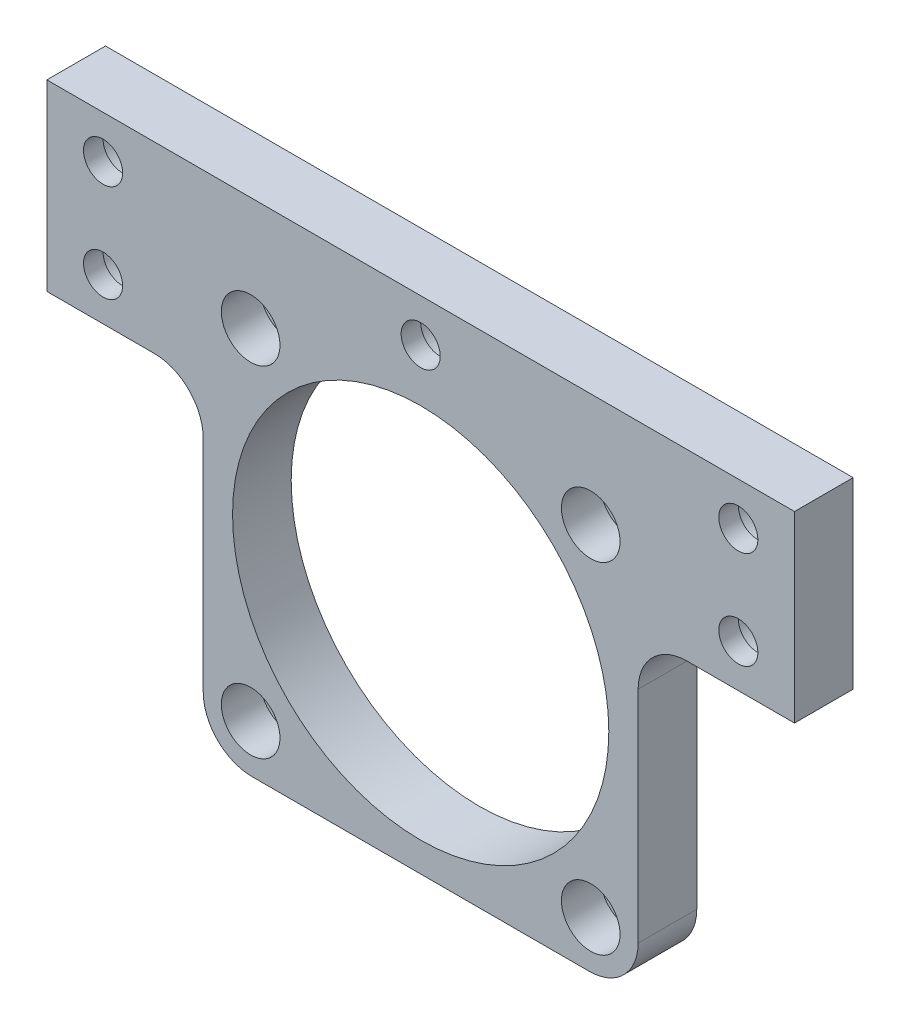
ISO-10303-21;
HEADER;
FILE_DESCRIPTION(('STEP AP214'),'2;1');
FILE_NAME('part.step','',(''),(''),'','','');
FILE_SCHEMA(('AUTOMOTIVE_DESIGN { 1 0 10303 214 1 1 1 1 }'));
ENDSEC;
DATA;
#1=APPLICATION_CONTEXT('core data for automotive mechanical design processes');
#2=APPLICATION_PROTOCOL_DEFINITION('international standard','automotive_design',2000,#1);
#3=PRODUCT_CONTEXT('',#1,'mechanical');
#4=PRODUCT('Part','Part','',(#3));
#5=PRODUCT_RELATED_PRODUCT_CATEGORY('part','',(#4));
#6=PRODUCT_DEFINITION_FORMATION('','',#4);
#7=PRODUCT_DEFINITION_CONTEXT('part definition',#1,'design');
#8=PRODUCT_DEFINITION('design','',#6,#7);
#9=PRODUCT_DEFINITION_SHAPE('','',#8);
#10=(LENGTH_UNIT() NAMED_UNIT(*) SI_UNIT(.MILLI.,.METRE.));
#11=(NAMED_UNIT(*) PLANE_ANGLE_UNIT() SI_UNIT($,.RADIAN.));
#12=(NAMED_UNIT(*) SI_UNIT($,.STERADIAN.) SOLID_ANGLE_UNIT());
#13=UNCERTAINTY_MEASURE_WITH_UNIT(LENGTH_MEASURE(1.E-05),#10,'distance_accuracy_value','');
#14=(GEOMETRIC_REPRESENTATION_CONTEXT(3) GLOBAL_UNCERTAINTY_ASSIGNED_CONTEXT((#13)) GLOBAL_UNIT_ASSIGNED_CONTEXT((#10,
#11,#12)) REPRESENTATION_CONTEXT('',''));
#15=CARTESIAN_POINT('',(0.,0.,0.));
#16=DIRECTION('',(0.,0.,1.));
#17=DIRECTION('',(1.,0.,0.));
#18=AXIS2_PLACEMENT_3D('',#15,#16,#17);
#19=CARTESIAN_POINT('',(11.5,-28.75,23.3137084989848));
#20=DIRECTION('',(0.,0.,-1.));
#21=DIRECTION('',(-1.,0.,0.));
#22=AXIS2_PLACEMENT_3D('',#19,#20,#21);
#23=CYLINDRICAL_SURFACE('',#22,3.99999999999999);
#24=CARTESIAN_POINT('',(11.5,-28.75,12.));
#25=DIRECTION('',(0.,0.,1.));
#26=DIRECTION('',(1.,0.,0.));
#27=AXIS2_PLACEMENT_3D('',#24,#25,#26);
#28=CIRCLE('',#27,3.99999999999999);
#29=CARTESIAN_POINT('',(15.5,-28.75,12.));
#30=VERTEX_POINT('',#29);
#31=EDGE_CURVE('E224',#30,#30,#28,.F.);
#32=ORIENTED_EDGE('',*,*,#31,.F.);
#33=EDGE_LOOP('',(#32));
#34=FACE_BOUND('',#33,.T.);
#35=CARTESIAN_POINT('',(11.5,-28.75,8.));
#36=DIRECTION('',(0.,0.,-1.));
#37=DIRECTION('',(-1.,0.,0.));
#38=AXIS2_PLACEMENT_3D('',#35,#36,#37);
#39=CIRCLE('',#38,3.99999999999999);
#40=CARTESIAN_POINT('',(7.50000000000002,-28.75,8.));
#41=VERTEX_POINT('',#40);
#42=EDGE_CURVE('E34',#41,#41,#39,.F.);
#43=ORIENTED_EDGE('',*,*,#42,.F.);
#44=EDGE_LOOP('',(#43));
#45=FACE_BOUND('',#44,.T.);
#46=ADVANCED_FACE('F30',(#34,#45),#23,.F.);
#47=CARTESIAN_POINT('',(11.5,-8.75000000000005,23.3137084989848));
#48=DIRECTION('',(0.,0.,-1.));
#49=DIRECTION('',(-1.,0.,0.));
#50=AXIS2_PLACEMENT_3D('',#47,#48,#49);
#51=CYLINDRICAL_SURFACE('',#50,3.99999999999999);
#52=CARTESIAN_POINT('',(11.5,-8.75000000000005,12.));
#53=DIRECTION('',(0.,0.,1.));
#54=DIRECTION('',(1.,0.,0.));
#55=AXIS2_PLACEMENT_3D('',#52,#53,#54);
#56=CIRCLE('',#55,3.99999999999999);
#57=CARTESIAN_POINT('',(15.5,-8.75000000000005,12.));
#58=VERTEX_POINT('',#57);
#59=EDGE_CURVE('E266',#58,#58,#56,.F.);
#60=ORIENTED_EDGE('',*,*,#59,.F.);
#61=EDGE_LOOP('',(#60));
#62=FACE_BOUND('',#61,.T.);
#63=CARTESIAN_POINT('',(11.5,-8.75000000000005,8.));
#64=DIRECTION('',(0.,0.,-1.));
#65=DIRECTION('',(-1.,0.,0.));
#66=AXIS2_PLACEMENT_3D('',#63,#64,#65);
#67=CIRCLE('',#66,3.99999999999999);
#68=CARTESIAN_POINT('',(7.50000000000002,-8.75000000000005,8.));
#69=VERTEX_POINT('',#68);
#70=EDGE_CURVE('E235',#69,#69,#67,.F.);
#71=ORIENTED_EDGE('',*,*,#70,.F.);
#72=EDGE_LOOP('',(#71));
#73=FACE_BOUND('',#72,.T.);
#74=ADVANCED_FACE('F356',(#62,#73),#51,.F.);
#75=CARTESIAN_POINT('',(76.5,-8.75000000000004,23.3137084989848));
#76=DIRECTION('',(0.,0.,-1.));
#77=DIRECTION('',(-1.,0.,0.));
#78=AXIS2_PLACEMENT_3D('',#75,#76,#77);
#79=CYLINDRICAL_SURFACE('',#78,3.99999999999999);
#80=CARTESIAN_POINT('',(76.5,-8.75000000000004,12.));
#81=DIRECTION('',(0.,0.,1.));
#82=DIRECTION('',(1.,0.,0.));
#83=AXIS2_PLACEMENT_3D('',#80,#81,#82);
#84=CIRCLE('',#83,3.99999999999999);
#85=CARTESIAN_POINT('',(80.5,-8.75000000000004,12.));
#86=VERTEX_POINT('',#85);
#87=EDGE_CURVE('E269',#86,#86,#84,.F.);
#88=ORIENTED_EDGE('',*,*,#87,.F.);
#89=EDGE_LOOP('',(#88));
#90=FACE_BOUND('',#89,.T.);
#91=CARTESIAN_POINT('',(76.5,-8.75000000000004,8.));
#92=DIRECTION('',(0.,0.,-1.));
#93=DIRECTION('',(-1.,0.,0.));
#94=AXIS2_PLACEMENT_3D('',#91,#92,#93);
#95=CIRCLE('',#94,3.99999999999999);
#96=CARTESIAN_POINT('',(72.5,-8.75000000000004,8.));
#97=VERTEX_POINT('',#96);
#98=EDGE_CURVE('E231',#97,#97,#95,.F.);
#99=ORIENTED_EDGE('',*,*,#98,.F.);
#100=EDGE_LOOP('',(#99));
#101=FACE_BOUND('',#100,.T.);
#102=ADVANCED_FACE('F362',(#90,#101),#79,.F.);
#103=CARTESIAN_POINT('',(141.5,-28.75,23.3137084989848));
#104=DIRECTION('',(0.,0.,-1.));
#105=DIRECTION('',(-1.,0.,0.));
#106=AXIS2_PLACEMENT_3D('',#103,#104,#105);
#107=CYLINDRICAL_SURFACE('',#106,3.99999999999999);
#108=CARTESIAN_POINT('',(141.5,-28.75,12.));
#109=DIRECTION('',(0.,0.,1.));
#110=DIRECTION('',(1.,0.,0.));
#111=AXIS2_PLACEMENT_3D('',#108,#109,#110);
#112=CIRCLE('',#111,3.99999999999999);
#113=CARTESIAN_POINT('',(145.5,-28.75,12.));
#114=VERTEX_POINT('',#113);
#115=EDGE_CURVE('E272',#114,#114,#112,.F.);
#116=ORIENTED_EDGE('',*,*,#115,.F.);
#117=EDGE_LOOP('',(#116));
#118=FACE_BOUND('',#117,.T.);
#119=CARTESIAN_POINT('',(141.5,-28.75,8.));
#120=DIRECTION('',(0.,0.,-1.));
#121=DIRECTION('',(-1.,0.,0.));
#122=AXIS2_PLACEMENT_3D('',#119,#120,#121);
#123=CIRCLE('',#122,3.99999999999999);
#124=CARTESIAN_POINT('',(137.5,-28.75,8.));
#125=VERTEX_POINT('',#124);
#126=EDGE_CURVE('E226',#125,#125,#123,.F.);
#127=ORIENTED_EDGE('',*,*,#126,.F.);
#128=EDGE_LOOP('',(#127));
#129=FACE_BOUND('',#128,.T.);
#130=ADVANCED_FACE('F373',(#118,#129),#107,.F.);
#131=CARTESIAN_POINT('',(141.5,-8.75000000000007,23.3137084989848));
#132=DIRECTION('',(0.,0.,-1.));
#133=DIRECTION('',(-1.,0.,0.));
#134=AXIS2_PLACEMENT_3D('',#131,#132,#133);
#135=CYLINDRICAL_SURFACE('',#134,3.99999999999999);
#136=CARTESIAN_POINT('',(141.5,-8.75000000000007,12.));
#137=DIRECTION('',(0.,0.,1.));
#138=DIRECTION('',(1.,0.,0.));
#139=AXIS2_PLACEMENT_3D('',#136,#137,#138);
#140=CIRCLE('',#139,3.99999999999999);
#141=CARTESIAN_POINT('',(145.5,-8.75000000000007,12.));
#142=VERTEX_POINT('',#141);
#143=EDGE_CURVE('E275',#142,#142,#140,.F.);
#144=ORIENTED_EDGE('',*,*,#143,.F.);
#145=EDGE_LOOP('',(#144));
#146=FACE_BOUND('',#145,.T.);
#147=CARTESIAN_POINT('',(141.5,-8.75000000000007,8.));
#148=DIRECTION('',(0.,0.,-1.));
#149=DIRECTION('',(-1.,0.,0.));
#150=AXIS2_PLACEMENT_3D('',#147,#148,#149);
#151=CIRCLE('',#150,3.99999999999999);
#152=CARTESIAN_POINT('',(137.5,-8.75000000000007,8.));
#153=VERTEX_POINT('',#152);
#154=EDGE_CURVE('E221',#153,#153,#151,.F.);
#155=ORIENTED_EDGE('',*,*,#154,.F.);
#156=EDGE_LOOP('',(#155));
#157=FACE_BOUND('',#156,.T.);
#158=ADVANCED_FACE('F377',(#146,#157),#135,.F.);
#159=CARTESIAN_POINT('',(111.3,-92.7999999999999,12.));
#160=DIRECTION('',(0.,0.,-1.));
#161=DIRECTION('',(-1.,0.,0.));
#162=AXIS2_PLACEMENT_3D('',#159,#160,#161);
#163=CYLINDRICAL_SURFACE('',#162,4.24999999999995);
#164=CARTESIAN_POINT('',(111.3,-92.7999999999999,0.));
#165=DIRECTION('',(0.,0.,1.));
#166=DIRECTION('',(1.,0.,0.));
#167=AXIS2_PLACEMENT_3D('',#164,#165,#166);
#168=CIRCLE('',#167,4.24999999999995);
#169=CARTESIAN_POINT('',(115.55,-92.7999999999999,0.));
#170=VERTEX_POINT('',#169);
#171=EDGE_CURVE('E303',#170,#170,#168,.T.);
#172=ORIENTED_EDGE('',*,*,#171,.F.);
#173=EDGE_LOOP('',(#172));
#174=FACE_BOUND('',#173,.T.);
#175=CARTESIAN_POINT('',(111.3,-92.7999999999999,4.));
#176=DIRECTION('',(0.,0.,1.));
#177=DIRECTION('',(1.,0.,0.));
#178=AXIS2_PLACEMENT_3D('',#175,#176,#177);
#179=CIRCLE('',#178,4.24999999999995);
#180=CARTESIAN_POINT('',(115.55,-92.7999999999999,4.));
#181=VERTEX_POINT('',#180);
#182=EDGE_CURVE('E216',#181,#181,#179,.T.);
#183=ORIENTED_EDGE('',*,*,#182,.T.);
#184=EDGE_LOOP('',(#183));
#185=FACE_BOUND('',#184,.T.);
#186=ADVANCED_FACE('F381',(#174,#185),#163,.F.);
#187=CARTESIAN_POINT('',(41.7,-92.7999999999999,12.));
#188=DIRECTION('',(0.,0.,-1.));
#189=DIRECTION('',(-1.,0.,0.));
#190=AXIS2_PLACEMENT_3D('',#187,#188,#189);
#191=CYLINDRICAL_SURFACE('',#190,4.24999999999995);
#192=CARTESIAN_POINT('',(41.7,-92.7999999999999,0.));
#193=DIRECTION('',(0.,0.,1.));
#194=DIRECTION('',(1.,0.,0.));
#195=AXIS2_PLACEMENT_3D('',#192,#193,#194);
#196=CIRCLE('',#195,4.24999999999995);
#197=CARTESIAN_POINT('',(45.95,-92.7999999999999,0.));
#198=VERTEX_POINT('',#197);
#199=EDGE_CURVE('E297',#198,#198,#196,.T.);
#200=ORIENTED_EDGE('',*,*,#199,.F.);
#201=EDGE_LOOP('',(#200));
#202=FACE_BOUND('',#201,.T.);
#203=CARTESIAN_POINT('',(41.7,-92.7999999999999,4.));
#204=DIRECTION('',(0.,0.,1.));
#205=DIRECTION('',(1.,0.,0.));
#206=AXIS2_PLACEMENT_3D('',#203,#204,#205);
#207=CIRCLE('',#206,4.24999999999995);
#208=CARTESIAN_POINT('',(45.95,-92.7999999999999,4.));
#209=VERTEX_POINT('',#208);
#210=EDGE_CURVE('E211',#209,#209,#207,.T.);
#211=ORIENTED_EDGE('',*,*,#210,.T.);
#212=EDGE_LOOP('',(#211));
#213=FACE_BOUND('',#212,.T.);
#214=ADVANCED_FACE('F420',(#202,#213),#191,.F.);
#215=CARTESIAN_POINT('',(111.3,-23.1999999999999,12.));
#216=DIRECTION('',(0.,0.,-1.));
#217=DIRECTION('',(-1.,0.,0.));
#218=AXIS2_PLACEMENT_3D('',#215,#216,#217);
#219=CYLINDRICAL_SURFACE('',#218,4.24999999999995);
#220=CARTESIAN_POINT('',(111.3,-23.1999999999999,0.));
#221=DIRECTION('',(0.,0.,1.));
#222=DIRECTION('',(1.,0.,0.));
#223=AXIS2_PLACEMENT_3D('',#220,#221,#222);
#224=CIRCLE('',#223,4.24999999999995);
#225=CARTESIAN_POINT('',(115.55,-23.1999999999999,0.));
#226=VERTEX_POINT('',#225);
#227=EDGE_CURVE('E300',#226,#226,#224,.T.);
#228=ORIENTED_EDGE('',*,*,#227,.F.);
#229=EDGE_LOOP('',(#228));
#230=FACE_BOUND('',#229,.T.);
#231=CARTESIAN_POINT('',(111.3,-23.1999999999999,4.));
#232=DIRECTION('',(0.,0.,1.));
#233=DIRECTION('',(1.,0.,0.));
#234=AXIS2_PLACEMENT_3D('',#231,#232,#233);
#235=CIRCLE('',#234,4.24999999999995);
#236=CARTESIAN_POINT('',(115.55,-23.1999999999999,4.));
#237=VERTEX_POINT('',#236);
#238=EDGE_CURVE('E206',#237,#237,#235,.T.);
#239=ORIENTED_EDGE('',*,*,#238,.T.);
#240=EDGE_LOOP('',(#239));
#241=FACE_BOUND('',#240,.T.);
#242=ADVANCED_FACE('F418',(#230,#241),#219,.F.);
#243=CARTESIAN_POINT('',(41.7,-23.1999999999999,12.));
#244=DIRECTION('',(0.,0.,-1.));
#245=DIRECTION('',(-1.,0.,0.));
#246=AXIS2_PLACEMENT_3D('',#243,#244,#245);
#247=CYLINDRICAL_SURFACE('',#246,4.24999999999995);
#248=CARTESIAN_POINT('',(41.7,-23.1999999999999,0.));
#249=DIRECTION('',(0.,0.,1.));
#250=DIRECTION('',(1.,0.,0.));
#251=AXIS2_PLACEMENT_3D('',#248,#249,#250);
#252=CIRCLE('',#251,4.24999999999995);
#253=CARTESIAN_POINT('',(45.95,-23.1999999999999,0.));
#254=VERTEX_POINT('',#253);
#255=EDGE_CURVE('E204',#254,#254,#252,.T.);
#256=ORIENTED_EDGE('',*,*,#255,.F.);
#257=EDGE_LOOP('',(#256));
#258=FACE_BOUND('',#257,.T.);
#259=CARTESIAN_POINT('',(41.7,-23.1999999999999,4.));
#260=DIRECTION('',(0.,0.,1.));
#261=DIRECTION('',(1.,0.,0.));
#262=AXIS2_PLACEMENT_3D('',#259,#260,#261);
#263=CIRCLE('',#262,4.24999999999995);
#264=CARTESIAN_POINT('',(45.95,-23.1999999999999,4.));
#265=VERTEX_POINT('',#264);
#266=EDGE_CURVE('E201',#265,#265,#263,.T.);
#267=ORIENTED_EDGE('',*,*,#266,.T.);
#268=EDGE_LOOP('',(#267));
#269=FACE_BOUND('',#268,.T.);
#270=ADVANCED_FACE('F415',(#258,#269),#247,.F.);
#271=CARTESIAN_POINT('',(42.0000000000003,-92.4999999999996,12.));
#272=DIRECTION('',(0.,0.,1.));
#273=DIRECTION('',(1.,0.,0.));
#274=AXIS2_PLACEMENT_3D('',#271,#272,#273);
#275=PLANE('',#274);
#276=ORIENTED_EDGE('',*,*,#31,.T.);
#277=EDGE_LOOP('',(#276));
#278=FACE_BOUND('',#277,.T.);
#279=ORIENTED_EDGE('',*,*,#59,.T.);
#280=EDGE_LOOP('',(#279));
#281=FACE_BOUND('',#280,.T.);
#282=ORIENTED_EDGE('',*,*,#87,.T.);
#283=EDGE_LOOP('',(#282));
#284=FACE_BOUND('',#283,.T.);
#285=ORIENTED_EDGE('',*,*,#115,.T.);
#286=EDGE_LOOP('',(#285));
#287=FACE_BOUND('',#286,.T.);
#288=ORIENTED_EDGE('',*,*,#143,.T.);
#289=EDGE_LOOP('',(#288));
#290=FACE_BOUND('',#289,.T.);
#291=CARTESIAN_POINT('',(111.3,-92.7999999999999,12.));
#292=DIRECTION('',(0.,0.,1.));
#293=DIRECTION('',(1.,0.,0.));
#294=AXIS2_PLACEMENT_3D('',#291,#292,#293);
#295=CIRCLE('',#294,5.99999999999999);
#296=CARTESIAN_POINT('',(117.3,-92.7999999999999,12.));
#297=VERTEX_POINT('',#296);
#298=EDGE_CURVE('E278',#297,#297,#295,.T.);
#299=ORIENTED_EDGE('',*,*,#298,.F.);
#300=EDGE_LOOP('',(#299));
#301=FACE_BOUND('',#300,.T.);
#302=CARTESIAN_POINT('',(41.7,-92.7999999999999,12.));
#303=DIRECTION('',(0.,0.,1.));
#304=DIRECTION('',(1.,0.,0.));
#305=AXIS2_PLACEMENT_3D('',#302,#303,#304);
#306=CIRCLE('',#305,5.99999999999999);
#307=CARTESIAN_POINT('',(47.7,-92.7999999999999,12.));
#308=VERTEX_POINT('',#307);
#309=EDGE_CURVE('E219',#308,#308,#306,.T.);
#310=ORIENTED_EDGE('',*,*,#309,.F.);
#311=EDGE_LOOP('',(#310));
#312=FACE_BOUND('',#311,.T.);
#313=CARTESIAN_POINT('',(111.3,-23.1999999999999,12.));
#314=DIRECTION('',(0.,0.,1.));
#315=DIRECTION('',(1.,0.,0.));
#316=AXIS2_PLACEMENT_3D('',#313,#314,#315);
#317=CIRCLE('',#316,5.99999999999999);
#318=CARTESIAN_POINT('',(117.3,-23.1999999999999,12.));
#319=VERTEX_POINT('',#318);
#320=EDGE_CURVE('E214',#319,#319,#317,.T.);
#321=ORIENTED_EDGE('',*,*,#320,.F.);
#322=EDGE_LOOP('',(#321));
#323=FACE_BOUND('',#322,.T.);
#324=CARTESIAN_POINT('',(41.7,-23.1999999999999,12.));
#325=DIRECTION('',(0.,0.,1.));
#326=DIRECTION('',(1.,0.,0.));
#327=AXIS2_PLACEMENT_3D('',#324,#325,#326);
#328=CIRCLE('',#327,5.99999999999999);
#329=CARTESIAN_POINT('',(47.7,-23.1999999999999,12.));
#330=VERTEX_POINT('',#329);
#331=EDGE_CURVE('E209',#330,#330,#328,.T.);
#332=ORIENTED_EDGE('',*,*,#331,.F.);
#333=EDGE_LOOP('',(#332));
#334=FACE_BOUND('',#333,.T.);
#335=CARTESIAN_POINT('',(42.0000000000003,-92.4999999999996,12.));
#336=DIRECTION('',(0.,0.,1.));
#337=DIRECTION('',(1.,0.,0.));
#338=AXIS2_PLACEMENT_3D('',#335,#336,#337);
#339=CIRCLE('',#338,10.0000000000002);
#340=CARTESIAN_POINT('',(32.0000000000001,-92.4999999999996,12.));
#341=VERTEX_POINT('',#340);
#342=CARTESIAN_POINT('',(42.0000000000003,-102.5,12.));
#343=VERTEX_POINT('',#342);
#344=EDGE_CURVE('E177',#341,#343,#339,.T.);
#345=ORIENTED_EDGE('',*,*,#344,.T.);
#346=DIRECTION('',(1.,0.,0.));
#347=VECTOR('',#346,1.);
#348=CARTESIAN_POINT('',(42.0000000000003,-102.5,12.));
#349=LINE('',#348,#347);
#350=CARTESIAN_POINT('',(111.,-102.5,12.));
#351=VERTEX_POINT('',#350);
#352=EDGE_CURVE('E104',#343,#351,#349,.T.);
#353=ORIENTED_EDGE('',*,*,#352,.T.);
#354=CARTESIAN_POINT('',(111.,-92.4999999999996,12.));
#355=DIRECTION('',(0.,0.,1.));
#356=DIRECTION('',(1.,0.,0.));
#357=AXIS2_PLACEMENT_3D('',#354,#355,#356);
#358=CIRCLE('',#357,10.0000000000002);
#359=CARTESIAN_POINT('',(121.,-92.4999999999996,12.));
#360=VERTEX_POINT('',#359);
#361=EDGE_CURVE('E313',#351,#360,#358,.T.);
#362=ORIENTED_EDGE('',*,*,#361,.T.);
#363=DIRECTION('',(0.,1.,0.));
#364=VECTOR('',#363,1.);
#365=CARTESIAN_POINT('',(121.,-92.4999999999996,12.));
#366=LINE('',#365,#364);
#367=CARTESIAN_POINT('',(121.,-47.5000000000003,12.));
#368=VERTEX_POINT('',#367);
#369=EDGE_CURVE('E315',#360,#368,#366,.T.);
#370=ORIENTED_EDGE('',*,*,#369,.T.);
#371=CARTESIAN_POINT('',(131.,-47.5000000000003,12.));
#372=DIRECTION('',(0.,0.,-1.));
#373=DIRECTION('',(1.,0.,0.));
#374=AXIS2_PLACEMENT_3D('',#371,#372,#373);
#375=CIRCLE('',#374,10.0000000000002);
#376=CARTESIAN_POINT('',(131.,-37.5000000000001,12.));
#377=VERTEX_POINT('',#376);
#378=EDGE_CURVE('E317',#368,#377,#375,.T.);
#379=ORIENTED_EDGE('',*,*,#378,.T.);
#380=DIRECTION('',(1.,0.,0.));
#381=VECTOR('',#380,1.);
#382=CARTESIAN_POINT('',(153.,-37.5000000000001,12.));
#383=LINE('',#382,#381);
#384=CARTESIAN_POINT('',(153.,-37.5000000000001,12.));
#385=VERTEX_POINT('',#384);
#386=EDGE_CURVE('E319',#377,#385,#383,.T.);
#387=ORIENTED_EDGE('',*,*,#386,.T.);
#388=DIRECTION('',(0.,1.,0.));
#389=VECTOR('',#388,1.);
#390=CARTESIAN_POINT('',(153.,0.,12.));
#391=LINE('',#390,#389);
#392=CARTESIAN_POINT('',(153.,0.,12.));
#393=VERTEX_POINT('',#392);
#394=EDGE_CURVE('E321',#385,#393,#391,.T.);
#395=ORIENTED_EDGE('',*,*,#394,.T.);
#396=DIRECTION('',(-1.,0.,0.));
#397=VECTOR('',#396,1.);
#398=CARTESIAN_POINT('',(0.,0.,12.));
#399=LINE('',#398,#397);
#400=CARTESIAN_POINT('',(0.,0.,12.));
#401=VERTEX_POINT('',#400);
#402=EDGE_CURVE('E323',#393,#401,#399,.T.);
#403=ORIENTED_EDGE('',*,*,#402,.T.);
#404=DIRECTION('',(0.,-1.,0.));
#405=VECTOR('',#404,1.);
#406=CARTESIAN_POINT('',(0.,-37.5000000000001,12.));
#407=LINE('',#406,#405);
#408=CARTESIAN_POINT('',(0.,-37.5000000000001,12.));
#409=VERTEX_POINT('',#408);
#410=EDGE_CURVE('E136',#401,#409,#407,.T.);
#411=ORIENTED_EDGE('',*,*,#410,.T.);
#412=DIRECTION('',(1.,0.,0.));
#413=VECTOR('',#412,1.);
#414=CARTESIAN_POINT('',(21.9999999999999,-37.5000000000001,12.));
#415=LINE('',#414,#413);
#416=CARTESIAN_POINT('',(21.9999999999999,-37.5000000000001,12.));
#417=VERTEX_POINT('',#416);
#418=EDGE_CURVE('E129',#409,#417,#415,.T.);
#419=ORIENTED_EDGE('',*,*,#418,.T.);
#420=CARTESIAN_POINT('',(21.9999999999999,-47.5000000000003,12.));
#421=DIRECTION('',(0.,0.,-1.));
#422=DIRECTION('',(1.,0.,0.));
#423=AXIS2_PLACEMENT_3D('',#420,#421,#422);
#424=CIRCLE('',#423,10.0000000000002);
#425=CARTESIAN_POINT('',(32.0000000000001,-47.5000000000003,12.));
#426=VERTEX_POINT('',#425);
#427=EDGE_CURVE('E134',#417,#426,#424,.T.);
#428=ORIENTED_EDGE('',*,*,#427,.T.);
#429=DIRECTION('',(0.,-1.,0.));
#430=VECTOR('',#429,1.);
#431=CARTESIAN_POINT('',(32.0000000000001,-47.5000000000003,12.));
#432=LINE('',#431,#430);
#433=EDGE_CURVE('E49',#426,#341,#432,.T.);
#434=ORIENTED_EDGE('',*,*,#433,.T.);
#435=EDGE_LOOP('',(#345,#353,#362,#370,#379,#387,#395,#403,#411,#419,#428,#434));
#436=FACE_BOUND('',#435,.T.);
#437=CARTESIAN_POINT('',(76.5000000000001,-58.,12.));
#438=DIRECTION('',(0.,0.,1.));
#439=DIRECTION('',(1.,0.,0.));
#440=AXIS2_PLACEMENT_3D('',#437,#438,#439);
#441=CIRCLE('',#440,38.5);
#442=CARTESIAN_POINT('',(115.,-58.,12.));
#443=VERTEX_POINT('',#442);
#444=EDGE_CURVE('E158',#443,#443,#441,.T.);
#445=ORIENTED_EDGE('',*,*,#444,.F.);
#446=EDGE_LOOP('',(#445));
#447=FACE_BOUND('',#446,.T.);
#448=ADVANCED_FACE('F131',(#278,#281,#284,#287,#290,#301,#312,#323,#334,#436,#447),#275,.T.);
#449=CARTESIAN_POINT('',(42.0000000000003,-92.4999999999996,0.));
#450=DIRECTION('',(0.,0.,1.));
#451=DIRECTION('',(1.,0.,0.));
#452=AXIS2_PLACEMENT_3D('',#449,#450,#451);
#453=PLANE('',#452);
#454=CARTESIAN_POINT('',(11.5,-28.75,0.));
#455=DIRECTION('',(0.,0.,-1.));
#456=DIRECTION('',(-1.,0.,0.));
#457=AXIS2_PLACEMENT_3D('',#454,#455,#456);
#458=CIRCLE('',#457,5.99999999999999);
#459=CARTESIAN_POINT('',(5.50000000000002,-28.75,0.));
#460=VERTEX_POINT('',#459);
#461=EDGE_CURVE('E251',#460,#460,#458,.T.);
#462=ORIENTED_EDGE('',*,*,#461,.F.);
#463=EDGE_LOOP('',(#462));
#464=FACE_BOUND('',#463,.T.);
#465=CARTESIAN_POINT('',(11.5,-8.75000000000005,0.));
#466=DIRECTION('',(0.,0.,-1.));
#467=DIRECTION('',(-1.,0.,0.));
#468=AXIS2_PLACEMENT_3D('',#465,#466,#467);
#469=CIRCLE('',#468,5.99999999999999);
#470=CARTESIAN_POINT('',(5.50000000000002,-8.75000000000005,0.));
#471=VERTEX_POINT('',#470);
#472=EDGE_CURVE('E244',#471,#471,#469,.T.);
#473=ORIENTED_EDGE('',*,*,#472,.F.);
#474=EDGE_LOOP('',(#473));
#475=FACE_BOUND('',#474,.T.);
#476=CARTESIAN_POINT('',(76.5,-8.75000000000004,0.));
#477=DIRECTION('',(0.,0.,-1.));
#478=DIRECTION('',(-1.,0.,0.));
#479=AXIS2_PLACEMENT_3D('',#476,#477,#478);
#480=CIRCLE('',#479,5.99999999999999);
#481=CARTESIAN_POINT('',(70.5,-8.75000000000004,0.));
#482=VERTEX_POINT('',#481);
#483=EDGE_CURVE('E237',#482,#482,#480,.T.);
#484=ORIENTED_EDGE('',*,*,#483,.F.);
#485=EDGE_LOOP('',(#484));
#486=FACE_BOUND('',#485,.T.);
#487=CARTESIAN_POINT('',(141.5,-28.75,0.));
#488=DIRECTION('',(0.,0.,-1.));
#489=DIRECTION('',(-1.,0.,0.));
#490=AXIS2_PLACEMENT_3D('',#487,#488,#489);
#491=CIRCLE('',#490,5.99999999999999);
#492=CARTESIAN_POINT('',(135.5,-28.75,0.));
#493=VERTEX_POINT('',#492);
#494=EDGE_CURVE('E233',#493,#493,#491,.T.);
#495=ORIENTED_EDGE('',*,*,#494,.F.);
#496=EDGE_LOOP('',(#495));
#497=FACE_BOUND('',#496,.T.);
#498=CARTESIAN_POINT('',(141.5,-8.75000000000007,0.));
#499=DIRECTION('',(0.,0.,-1.));
#500=DIRECTION('',(-1.,0.,0.));
#501=AXIS2_PLACEMENT_3D('',#498,#499,#500);
#502=CIRCLE('',#501,5.99999999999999);
#503=CARTESIAN_POINT('',(135.5,-8.75000000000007,0.));
#504=VERTEX_POINT('',#503);
#505=EDGE_CURVE('E229',#504,#504,#502,.T.);
#506=ORIENTED_EDGE('',*,*,#505,.F.);
#507=EDGE_LOOP('',(#506));
#508=FACE_BOUND('',#507,.T.);
#509=ORIENTED_EDGE('',*,*,#199,.T.);
#510=EDGE_LOOP('',(#509));
#511=FACE_BOUND('',#510,.T.);
#512=ORIENTED_EDGE('',*,*,#171,.T.);
#513=EDGE_LOOP('',(#512));
#514=FACE_BOUND('',#513,.T.);
#515=CARTESIAN_POINT('',(42.0000000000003,-92.4999999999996,0.));
#516=DIRECTION('',(0.,0.,1.));
#517=DIRECTION('',(1.,0.,0.));
#518=AXIS2_PLACEMENT_3D('',#515,#516,#517);
#519=CIRCLE('',#518,10.0000000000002);
#520=CARTESIAN_POINT('',(32.0000000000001,-92.4999999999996,0.));
#521=VERTEX_POINT('',#520);
#522=CARTESIAN_POINT('',(42.0000000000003,-102.5,0.));
#523=VERTEX_POINT('',#522);
#524=EDGE_CURVE('E154',#521,#523,#519,.T.);
#525=ORIENTED_EDGE('',*,*,#524,.F.);
#526=DIRECTION('',(0.,-1.,0.));
#527=VECTOR('',#526,1.);
#528=CARTESIAN_POINT('',(32.0000000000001,-47.5000000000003,0.));
#529=LINE('',#528,#527);
#530=CARTESIAN_POINT('',(32.0000000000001,-47.5000000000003,0.));
#531=VERTEX_POINT('',#530);
#532=EDGE_CURVE('E96',#531,#521,#529,.T.);
#533=ORIENTED_EDGE('',*,*,#532,.F.);
#534=CARTESIAN_POINT('',(21.9999999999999,-47.5000000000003,0.));
#535=DIRECTION('',(0.,0.,-1.));
#536=DIRECTION('',(1.,0.,0.));
#537=AXIS2_PLACEMENT_3D('',#534,#535,#536);
#538=CIRCLE('',#537,10.0000000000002);
#539=CARTESIAN_POINT('',(21.9999999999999,-37.5000000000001,0.));
#540=VERTEX_POINT('',#539);
#541=EDGE_CURVE('E90',#540,#531,#538,.T.);
#542=ORIENTED_EDGE('',*,*,#541,.F.);
#543=DIRECTION('',(1.,0.,0.));
#544=VECTOR('',#543,1.);
#545=CARTESIAN_POINT('',(21.9999999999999,-37.5000000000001,0.));
#546=LINE('',#545,#544);
#547=CARTESIAN_POINT('',(0.,-37.5000000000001,0.));
#548=VERTEX_POINT('',#547);
#549=EDGE_CURVE('E144',#548,#540,#546,.T.);
#550=ORIENTED_EDGE('',*,*,#549,.F.);
#551=DIRECTION('',(0.,-1.,0.));
#552=VECTOR('',#551,1.);
#553=CARTESIAN_POINT('',(0.,-37.5000000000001,0.));
#554=LINE('',#553,#552);
#555=CARTESIAN_POINT('',(0.,0.,0.));
#556=VERTEX_POINT('',#555);
#557=EDGE_CURVE('E172',#556,#548,#554,.T.);
#558=ORIENTED_EDGE('',*,*,#557,.F.);
#559=DIRECTION('',(-1.,0.,0.));
#560=VECTOR('',#559,1.);
#561=CARTESIAN_POINT('',(0.,0.,0.));
#562=LINE('',#561,#560);
#563=CARTESIAN_POINT('',(153.,0.,0.));
#564=VERTEX_POINT('',#563);
#565=EDGE_CURVE('E170',#564,#556,#562,.T.);
#566=ORIENTED_EDGE('',*,*,#565,.F.);
#567=DIRECTION('',(0.,1.,0.));
#568=VECTOR('',#567,1.);
#569=CARTESIAN_POINT('',(153.,0.,0.));
#570=LINE('',#569,#568);
#571=CARTESIAN_POINT('',(153.,-37.5000000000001,0.));
#572=VERTEX_POINT('',#571);
#573=EDGE_CURVE('E168',#572,#564,#570,.T.);
#574=ORIENTED_EDGE('',*,*,#573,.F.);
#575=DIRECTION('',(1.,0.,0.));
#576=VECTOR('',#575,1.);
#577=CARTESIAN_POINT('',(153.,-37.5000000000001,0.));
#578=LINE('',#577,#576);
#579=CARTESIAN_POINT('',(131.,-37.5000000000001,0.));
#580=VERTEX_POINT('',#579);
#581=EDGE_CURVE('E166',#580,#572,#578,.T.);
#582=ORIENTED_EDGE('',*,*,#581,.F.);
#583=CARTESIAN_POINT('',(131.,-47.5000000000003,0.));
#584=DIRECTION('',(0.,0.,-1.));
#585=DIRECTION('',(1.,0.,0.));
#586=AXIS2_PLACEMENT_3D('',#583,#584,#585);
#587=CIRCLE('',#586,10.0000000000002);
#588=CARTESIAN_POINT('',(121.,-47.5000000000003,0.));
#589=VERTEX_POINT('',#588);
#590=EDGE_CURVE('E164',#589,#580,#587,.T.);
#591=ORIENTED_EDGE('',*,*,#590,.F.);
#592=DIRECTION('',(0.,1.,0.));
#593=VECTOR('',#592,1.);
#594=CARTESIAN_POINT('',(121.,-92.4999999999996,0.));
#595=LINE('',#594,#593);
#596=CARTESIAN_POINT('',(121.,-92.4999999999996,0.));
#597=VERTEX_POINT('',#596);
#598=EDGE_CURVE('E162',#597,#589,#595,.T.);
#599=ORIENTED_EDGE('',*,*,#598,.F.);
#600=CARTESIAN_POINT('',(111.,-92.4999999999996,0.));
#601=DIRECTION('',(0.,0.,1.));
#602=DIRECTION('',(1.,0.,0.));
#603=AXIS2_PLACEMENT_3D('',#600,#601,#602);
#604=CIRCLE('',#603,10.0000000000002);
#605=CARTESIAN_POINT('',(111.,-102.5,0.));
#606=VERTEX_POINT('',#605);
#607=EDGE_CURVE('E160',#606,#597,#604,.T.);
#608=ORIENTED_EDGE('',*,*,#607,.F.);
#609=DIRECTION('',(1.,0.,0.));
#610=VECTOR('',#609,1.);
#611=CARTESIAN_POINT('',(42.0000000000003,-102.5,0.));
#612=LINE('',#611,#610);
#613=EDGE_CURVE('E157',#523,#606,#612,.T.);
#614=ORIENTED_EDGE('',*,*,#613,.F.);
#615=EDGE_LOOP('',(#525,#533,#542,#550,#558,#566,#574,#582,#591,#599,#608,#614));
#616=FACE_BOUND('',#615,.T.);
#617=CARTESIAN_POINT('',(76.5000000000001,-58.,0.));
#618=DIRECTION('',(0.,0.,1.));
#619=DIRECTION('',(1.,0.,0.));
#620=AXIS2_PLACEMENT_3D('',#617,#618,#619);
#621=CIRCLE('',#620,38.5);
#622=CARTESIAN_POINT('',(115.,-58.,0.));
#623=VERTEX_POINT('',#622);
#624=EDGE_CURVE('E306',#623,#623,#621,.T.);
#625=ORIENTED_EDGE('',*,*,#624,.T.);
#626=EDGE_LOOP('',(#625));
#627=FACE_BOUND('',#626,.T.);
#628=ORIENTED_EDGE('',*,*,#227,.T.);
#629=EDGE_LOOP('',(#628));
#630=FACE_BOUND('',#629,.T.);
#631=ORIENTED_EDGE('',*,*,#255,.T.);
#632=EDGE_LOOP('',(#631));
#633=FACE_BOUND('',#632,.T.);
#634=ADVANCED_FACE('F336',(#464,#475,#486,#497,#508,#511,#514,#616,#627,#630,#633),#453,.F.);
#635=CARTESIAN_POINT('',(42.0000000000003,-92.4999999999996,12.));
#636=DIRECTION('',(0.,0.,-1.));
#637=DIRECTION('',(-1.,0.,0.));
#638=AXIS2_PLACEMENT_3D('',#635,#636,#637);
#639=CYLINDRICAL_SURFACE('',#638,10.0000000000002);
#640=ORIENTED_EDGE('',*,*,#524,.T.);
#641=DIRECTION('',(0.,0.,-1.));
#642=VECTOR('',#641,1.);
#643=CARTESIAN_POINT('',(42.0000000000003,-102.5,12.));
#644=LINE('',#643,#642);
#645=EDGE_CURVE('E11',#343,#523,#644,.T.);
#646=ORIENTED_EDGE('',*,*,#645,.F.);
#647=ORIENTED_EDGE('',*,*,#344,.F.);
#648=DIRECTION('',(0.,0.,-1.));
#649=VECTOR('',#648,1.);
#650=CARTESIAN_POINT('',(32.0000000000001,-92.4999999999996,12.));
#651=LINE('',#650,#649);
#652=EDGE_CURVE('E150',#341,#521,#651,.T.);
#653=ORIENTED_EDGE('',*,*,#652,.T.);
#654=EDGE_LOOP('',(#640,#646,#647,#653));
#655=FACE_BOUND('',#654,.T.);
#656=ADVANCED_FACE('F32',(#655),#639,.T.);
#657=CARTESIAN_POINT('',(42.0000000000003,-102.5,12.));
#658=DIRECTION('',(0.,1.,0.));
#659=DIRECTION('',(0.,0.,1.));
#660=AXIS2_PLACEMENT_3D('',#657,#658,#659);
#661=PLANE('',#660);
#662=ORIENTED_EDGE('',*,*,#613,.T.);
#663=DIRECTION('',(0.,0.,-1.));
#664=VECTOR('',#663,1.);
#665=CARTESIAN_POINT('',(111.,-102.5,12.));
#666=LINE('',#665,#664);
#667=EDGE_CURVE('E40',#351,#606,#666,.T.);
#668=ORIENTED_EDGE('',*,*,#667,.F.);
#669=ORIENTED_EDGE('',*,*,#352,.F.);
#670=ORIENTED_EDGE('',*,*,#645,.T.);
#671=EDGE_LOOP('',(#662,#668,#669,#670));
#672=FACE_BOUND('',#671,.T.);
#673=ADVANCED_FACE('F437',(#672),#661,.F.);
#674=CARTESIAN_POINT('',(111.,-92.4999999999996,12.));
#675=DIRECTION('',(0.,0.,-1.));
#676=DIRECTION('',(-1.,0.,0.));
#677=AXIS2_PLACEMENT_3D('',#674,#675,#676);
#678=CYLINDRICAL_SURFACE('',#677,10.0000000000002);
#679=ORIENTED_EDGE('',*,*,#607,.T.);
#680=DIRECTION('',(0.,0.,-1.));
#681=VECTOR('',#680,1.);
#682=CARTESIAN_POINT('',(121.,-92.4999999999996,12.));
#683=LINE('',#682,#681);
#684=EDGE_CURVE('E196',#360,#597,#683,.T.);
#685=ORIENTED_EDGE('',*,*,#684,.F.);
#686=ORIENTED_EDGE('',*,*,#361,.F.);
#687=ORIENTED_EDGE('',*,*,#667,.T.);
#688=EDGE_LOOP('',(#679,#685,#686,#687));
#689=FACE_BOUND('',#688,.T.);
#690=ADVANCED_FACE('F728',(#689),#678,.T.);
#691=CARTESIAN_POINT('',(121.,-92.4999999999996,12.));
#692=DIRECTION('',(-1.,0.,0.));
#693=DIRECTION('',(0.,0.,1.));
#694=AXIS2_PLACEMENT_3D('',#691,#692,#693);
#695=PLANE('',#694);
#696=ORIENTED_EDGE('',*,*,#598,.T.);
#697=DIRECTION('',(0.,0.,-1.));
#698=VECTOR('',#697,1.);
#699=CARTESIAN_POINT('',(121.,-47.5000000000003,12.));
#700=LINE('',#699,#698);
#701=EDGE_CURVE('E193',#368,#589,#700,.T.);
#702=ORIENTED_EDGE('',*,*,#701,.F.);
#703=ORIENTED_EDGE('',*,*,#369,.F.);
#704=ORIENTED_EDGE('',*,*,#684,.T.);
#705=EDGE_LOOP('',(#696,#702,#703,#704));
#706=FACE_BOUND('',#705,.T.);
#707=ADVANCED_FACE('F719',(#706),#695,.F.);
#708=CARTESIAN_POINT('',(131.,-47.5000000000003,12.));
#709=DIRECTION('',(0.,0.,-1.));
#710=DIRECTION('',(-1.,0.,0.));
#711=AXIS2_PLACEMENT_3D('',#708,#709,#710);
#712=CYLINDRICAL_SURFACE('',#711,10.0000000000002);
#713=ORIENTED_EDGE('',*,*,#590,.T.);
#714=DIRECTION('',(0.,0.,-1.));
#715=VECTOR('',#714,1.);
#716=CARTESIAN_POINT('',(131.,-37.5000000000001,12.));
#717=LINE('',#716,#715);
#718=EDGE_CURVE('E190',#377,#580,#717,.T.);
#719=ORIENTED_EDGE('',*,*,#718,.F.);
#720=ORIENTED_EDGE('',*,*,#378,.F.);
#721=ORIENTED_EDGE('',*,*,#701,.T.);
#722=EDGE_LOOP('',(#713,#719,#720,#721));
#723=FACE_BOUND('',#722,.T.);
#724=ADVANCED_FACE('F710',(#723),#712,.F.);
#725=CARTESIAN_POINT('',(153.,-37.5000000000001,12.));
#726=DIRECTION('',(0.,1.,0.));
#727=DIRECTION('',(0.,0.,1.));
#728=AXIS2_PLACEMENT_3D('',#725,#726,#727);
#729=PLANE('',#728);
#730=ORIENTED_EDGE('',*,*,#581,.T.);
#731=DIRECTION('',(0.,0.,-1.));
#732=VECTOR('',#731,1.);
#733=CARTESIAN_POINT('',(153.,-37.5000000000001,12.));
#734=LINE('',#733,#732);
#735=EDGE_CURVE('E187',#385,#572,#734,.T.);
#736=ORIENTED_EDGE('',*,*,#735,.F.);
#737=ORIENTED_EDGE('',*,*,#386,.F.);
#738=ORIENTED_EDGE('',*,*,#718,.T.);
#739=EDGE_LOOP('',(#730,#736,#737,#738));
#740=FACE_BOUND('',#739,.T.);
#741=ADVANCED_FACE('F701',(#740),#729,.F.);
#742=CARTESIAN_POINT('',(153.,0.,12.));
#743=DIRECTION('',(-1.,0.,0.));
#744=DIRECTION('',(0.,0.,1.));
#745=AXIS2_PLACEMENT_3D('',#742,#743,#744);
#746=PLANE('',#745);
#747=ORIENTED_EDGE('',*,*,#573,.T.);
#748=DIRECTION('',(0.,0.,-1.));
#749=VECTOR('',#748,1.);
#750=CARTESIAN_POINT('',(153.,0.,12.));
#751=LINE('',#750,#749);
#752=EDGE_CURVE('E184',#393,#564,#751,.T.);
#753=ORIENTED_EDGE('',*,*,#752,.F.);
#754=ORIENTED_EDGE('',*,*,#394,.F.);
#755=ORIENTED_EDGE('',*,*,#735,.T.);
#756=EDGE_LOOP('',(#747,#753,#754,#755));
#757=FACE_BOUND('',#756,.T.);
#758=ADVANCED_FACE('F693',(#757),#746,.F.);
#759=CARTESIAN_POINT('',(0.,0.,12.));
#760=DIRECTION('',(0.,-1.,0.));
#761=DIRECTION('',(0.,0.,-1.));
#762=AXIS2_PLACEMENT_3D('',#759,#760,#761);
#763=PLANE('',#762);
#764=ORIENTED_EDGE('',*,*,#565,.T.);
#765=DIRECTION('',(0.,0.,-1.));
#766=VECTOR('',#765,1.);
#767=CARTESIAN_POINT('',(0.,0.,12.));
#768=LINE('',#767,#766);
#769=EDGE_CURVE('E181',#401,#556,#768,.T.);
#770=ORIENTED_EDGE('',*,*,#769,.F.);
#771=ORIENTED_EDGE('',*,*,#402,.F.);
#772=ORIENTED_EDGE('',*,*,#752,.T.);
#773=EDGE_LOOP('',(#764,#770,#771,#772));
#774=FACE_BOUND('',#773,.T.);
#775=ADVANCED_FACE('F329',(#774),#763,.F.);
#776=CARTESIAN_POINT('',(0.,-37.5000000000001,12.));
#777=DIRECTION('',(1.,0.,0.));
#778=DIRECTION('',(0.,0.,-1.));
#779=AXIS2_PLACEMENT_3D('',#776,#777,#778);
#780=PLANE('',#779);
#781=ORIENTED_EDGE('',*,*,#557,.T.);
#782=DIRECTION('',(0.,0.,-1.));
#783=VECTOR('',#782,1.);
#784=CARTESIAN_POINT('',(0.,-37.5000000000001,12.));
#785=LINE('',#784,#783);
#786=EDGE_CURVE('E145',#409,#548,#785,.T.);
#787=ORIENTED_EDGE('',*,*,#786,.F.);
#788=ORIENTED_EDGE('',*,*,#410,.F.);
#789=ORIENTED_EDGE('',*,*,#769,.T.);
#790=EDGE_LOOP('',(#781,#787,#788,#789));
#791=FACE_BOUND('',#790,.T.);
#792=ADVANCED_FACE('F333',(#791),#780,.F.);
#793=CARTESIAN_POINT('',(21.9999999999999,-37.5000000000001,12.));
#794=DIRECTION('',(0.,1.,0.));
#795=DIRECTION('',(-1.,0.,0.));
#796=AXIS2_PLACEMENT_3D('',#793,#794,#795);
#797=PLANE('',#796);
#798=ORIENTED_EDGE('',*,*,#549,.T.);
#799=DIRECTION('',(0.,0.,-1.));
#800=VECTOR('',#799,1.);
#801=CARTESIAN_POINT('',(21.9999999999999,-37.5000000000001,12.));
#802=LINE('',#801,#800);
#803=EDGE_CURVE('E141',#417,#540,#802,.T.);
#804=ORIENTED_EDGE('',*,*,#803,.F.);
#805=ORIENTED_EDGE('',*,*,#418,.F.);
#806=ORIENTED_EDGE('',*,*,#786,.T.);
#807=EDGE_LOOP('',(#798,#804,#805,#806));
#808=FACE_BOUND('',#807,.T.);
#809=ADVANCED_FACE('F142',(#808),#797,.F.);
#810=CARTESIAN_POINT('',(21.9999999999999,-47.5000000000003,12.));
#811=DIRECTION('',(0.,0.,-1.));
#812=DIRECTION('',(-1.,0.,0.));
#813=AXIS2_PLACEMENT_3D('',#810,#811,#812);
#814=CYLINDRICAL_SURFACE('',#813,10.0000000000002);
#815=ORIENTED_EDGE('',*,*,#541,.T.);
#816=DIRECTION('',(0.,0.,-1.));
#817=VECTOR('',#816,1.);
#818=CARTESIAN_POINT('',(32.0000000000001,-47.5000000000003,12.));
#819=LINE('',#818,#817);
#820=EDGE_CURVE('E146',#426,#531,#819,.T.);
#821=ORIENTED_EDGE('',*,*,#820,.F.);
#822=ORIENTED_EDGE('',*,*,#427,.F.);
#823=ORIENTED_EDGE('',*,*,#803,.T.);
#824=EDGE_LOOP('',(#815,#821,#822,#823));
#825=FACE_BOUND('',#824,.T.);
#826=ADVANCED_FACE('F148',(#825),#814,.F.);
#827=CARTESIAN_POINT('',(32.0000000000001,-47.5000000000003,12.));
#828=DIRECTION('',(1.,0.,0.));
#829=DIRECTION('',(0.,0.,-1.));
#830=AXIS2_PLACEMENT_3D('',#827,#828,#829);
#831=PLANE('',#830);
#832=ORIENTED_EDGE('',*,*,#532,.T.);
#833=ORIENTED_EDGE('',*,*,#652,.F.);
#834=ORIENTED_EDGE('',*,*,#433,.F.);
#835=ORIENTED_EDGE('',*,*,#820,.T.);
#836=EDGE_LOOP('',(#832,#833,#834,#835));
#837=FACE_BOUND('',#836,.T.);
#838=ADVANCED_FACE('F342',(#837),#831,.F.);
#839=CARTESIAN_POINT('',(76.5000000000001,-58.,12.));
#840=DIRECTION('',(0.,0.,-1.));
#841=DIRECTION('',(-1.,0.,0.));
#842=AXIS2_PLACEMENT_3D('',#839,#840,#841);
#843=CYLINDRICAL_SURFACE('',#842,38.5);
#844=ORIENTED_EDGE('',*,*,#444,.T.);
#845=EDGE_LOOP('',(#844));
#846=FACE_BOUND('',#845,.T.);
#847=ORIENTED_EDGE('',*,*,#624,.F.);
#848=EDGE_LOOP('',(#847));
#849=FACE_BOUND('',#848,.T.);
#850=ADVANCED_FACE('F344',(#846,#849),#843,.F.);
#851=CARTESIAN_POINT('',(41.7,-23.1999999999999,4.));
#852=DIRECTION('',(0.,0.,1.));
#853=DIRECTION('',(1.,0.,0.));
#854=AXIS2_PLACEMENT_3D('',#851,#852,#853);
#855=CYLINDRICAL_SURFACE('',#854,5.99999999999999);
#856=CARTESIAN_POINT('',(41.7,-23.1999999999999,4.));
#857=DIRECTION('',(0.,0.,1.));
#858=DIRECTION('',(1.,0.,0.));
#859=AXIS2_PLACEMENT_3D('',#856,#857,#858);
#860=CIRCLE('',#859,5.99999999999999);
#861=CARTESIAN_POINT('',(47.7,-23.1999999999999,4.));
#862=VERTEX_POINT('',#861);
#863=EDGE_CURVE('E205',#862,#862,#860,.T.);
#864=ORIENTED_EDGE('',*,*,#863,.F.);
#865=EDGE_LOOP('',(#864));
#866=FACE_BOUND('',#865,.T.);
#867=ORIENTED_EDGE('',*,*,#331,.T.);
#868=EDGE_LOOP('',(#867));
#869=FACE_BOUND('',#868,.T.);
#870=ADVANCED_FACE('F350',(#866,#869),#855,.F.);
#871=CARTESIAN_POINT('',(41.7,-23.1999999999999,4.));
#872=DIRECTION('',(0.,0.,1.));
#873=DIRECTION('',(1.,0.,0.));
#874=AXIS2_PLACEMENT_3D('',#871,#872,#873);
#875=PLANE('',#874);
#876=ORIENTED_EDGE('',*,*,#266,.F.);
#877=EDGE_LOOP('',(#876));
#878=FACE_BOUND('',#877,.T.);
#879=ORIENTED_EDGE('',*,*,#863,.T.);
#880=EDGE_LOOP('',(#879));
#881=FACE_BOUND('',#880,.T.);
#882=ADVANCED_FACE('F407',(#878,#881),#875,.T.);
#883=CARTESIAN_POINT('',(111.3,-23.1999999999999,4.));
#884=DIRECTION('',(0.,0.,1.));
#885=DIRECTION('',(1.,0.,0.));
#886=AXIS2_PLACEMENT_3D('',#883,#884,#885);
#887=CYLINDRICAL_SURFACE('',#886,5.99999999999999);
#888=CARTESIAN_POINT('',(111.3,-23.1999999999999,4.));
#889=DIRECTION('',(0.,0.,1.));
#890=DIRECTION('',(1.,0.,0.));
#891=AXIS2_PLACEMENT_3D('',#888,#889,#890);
#892=CIRCLE('',#891,5.99999999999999);
#893=CARTESIAN_POINT('',(117.3,-23.1999999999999,4.));
#894=VERTEX_POINT('',#893);
#895=EDGE_CURVE('E210',#894,#894,#892,.T.);
#896=ORIENTED_EDGE('',*,*,#895,.F.);
#897=EDGE_LOOP('',(#896));
#898=FACE_BOUND('',#897,.T.);
#899=ORIENTED_EDGE('',*,*,#320,.T.);
#900=EDGE_LOOP('',(#899));
#901=FACE_BOUND('',#900,.T.);
#902=ADVANCED_FACE('F403',(#898,#901),#887,.F.);
#903=CARTESIAN_POINT('',(111.3,-23.1999999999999,4.));
#904=DIRECTION('',(0.,0.,1.));
#905=DIRECTION('',(1.,0.,0.));
#906=AXIS2_PLACEMENT_3D('',#903,#904,#905);
#907=PLANE('',#906);
#908=ORIENTED_EDGE('',*,*,#238,.F.);
#909=EDGE_LOOP('',(#908));
#910=FACE_BOUND('',#909,.T.);
#911=ORIENTED_EDGE('',*,*,#895,.T.);
#912=EDGE_LOOP('',(#911));
#913=FACE_BOUND('',#912,.T.);
#914=ADVANCED_FACE('F399',(#910,#913),#907,.T.);
#915=CARTESIAN_POINT('',(41.7,-92.7999999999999,4.));
#916=DIRECTION('',(0.,0.,1.));
#917=DIRECTION('',(1.,0.,0.));
#918=AXIS2_PLACEMENT_3D('',#915,#916,#917);
#919=CYLINDRICAL_SURFACE('',#918,5.99999999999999);
#920=CARTESIAN_POINT('',(41.7,-92.7999999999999,4.));
#921=DIRECTION('',(0.,0.,1.));
#922=DIRECTION('',(1.,0.,0.));
#923=AXIS2_PLACEMENT_3D('',#920,#921,#922);
#924=CIRCLE('',#923,5.99999999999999);
#925=CARTESIAN_POINT('',(47.7,-92.7999999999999,4.));
#926=VERTEX_POINT('',#925);
#927=EDGE_CURVE('E215',#926,#926,#924,.T.);
#928=ORIENTED_EDGE('',*,*,#927,.F.);
#929=EDGE_LOOP('',(#928));
#930=FACE_BOUND('',#929,.T.);
#931=ORIENTED_EDGE('',*,*,#309,.T.);
#932=EDGE_LOOP('',(#931));
#933=FACE_BOUND('',#932,.T.);
#934=ADVANCED_FACE('F395',(#930,#933),#919,.F.);
#935=CARTESIAN_POINT('',(41.7,-92.7999999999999,4.));
#936=DIRECTION('',(0.,0.,1.));
#937=DIRECTION('',(1.,0.,0.));
#938=AXIS2_PLACEMENT_3D('',#935,#936,#937);
#939=PLANE('',#938);
#940=ORIENTED_EDGE('',*,*,#210,.F.);
#941=EDGE_LOOP('',(#940));
#942=FACE_BOUND('',#941,.T.);
#943=ORIENTED_EDGE('',*,*,#927,.T.);
#944=EDGE_LOOP('',(#943));
#945=FACE_BOUND('',#944,.T.);
#946=ADVANCED_FACE('F391',(#942,#945),#939,.T.);
#947=CARTESIAN_POINT('',(111.3,-92.7999999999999,4.));
#948=DIRECTION('',(0.,0.,1.));
#949=DIRECTION('',(1.,0.,0.));
#950=AXIS2_PLACEMENT_3D('',#947,#948,#949);
#951=CYLINDRICAL_SURFACE('',#950,5.99999999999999);
#952=CARTESIAN_POINT('',(111.3,-92.7999999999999,4.));
#953=DIRECTION('',(0.,0.,1.));
#954=DIRECTION('',(1.,0.,0.));
#955=AXIS2_PLACEMENT_3D('',#952,#953,#954);
#956=CIRCLE('',#955,5.99999999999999);
#957=CARTESIAN_POINT('',(117.3,-92.7999999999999,4.));
#958=VERTEX_POINT('',#957);
#959=EDGE_CURVE('E220',#958,#958,#956,.T.);
#960=ORIENTED_EDGE('',*,*,#959,.F.);
#961=EDGE_LOOP('',(#960));
#962=FACE_BOUND('',#961,.T.);
#963=ORIENTED_EDGE('',*,*,#298,.T.);
#964=EDGE_LOOP('',(#963));
#965=FACE_BOUND('',#964,.T.);
#966=ADVANCED_FACE('F387',(#962,#965),#951,.F.);
#967=CARTESIAN_POINT('',(111.3,-92.7999999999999,4.));
#968=DIRECTION('',(0.,0.,1.));
#969=DIRECTION('',(1.,0.,0.));
#970=AXIS2_PLACEMENT_3D('',#967,#968,#969);
#971=PLANE('',#970);
#972=ORIENTED_EDGE('',*,*,#182,.F.);
#973=EDGE_LOOP('',(#972));
#974=FACE_BOUND('',#973,.T.);
#975=ORIENTED_EDGE('',*,*,#959,.T.);
#976=EDGE_LOOP('',(#975));
#977=FACE_BOUND('',#976,.T.);
#978=ADVANCED_FACE('F383',(#974,#977),#971,.T.);
#979=CARTESIAN_POINT('',(141.5,-8.75000000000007,8.));
#980=DIRECTION('',(0.,0.,-1.));
#981=DIRECTION('',(-1.,0.,0.));
#982=AXIS2_PLACEMENT_3D('',#979,#980,#981);
#983=PLANE('',#982);
#984=CARTESIAN_POINT('',(141.5,-8.75000000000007,8.));
#985=DIRECTION('',(0.,0.,-1.));
#986=DIRECTION('',(-1.,0.,0.));
#987=AXIS2_PLACEMENT_3D('',#984,#985,#986);
#988=CIRCLE('',#987,5.99999999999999);
#989=CARTESIAN_POINT('',(135.5,-8.75000000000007,8.));
#990=VERTEX_POINT('',#989);
#991=EDGE_CURVE('E225',#990,#990,#988,.T.);
#992=ORIENTED_EDGE('',*,*,#991,.T.);
#993=EDGE_LOOP('',(#992));
#994=FACE_BOUND('',#993,.T.);
#995=ORIENTED_EDGE('',*,*,#154,.T.);
#996=EDGE_LOOP('',(#995));
#997=FACE_BOUND('',#996,.T.);
#998=ADVANCED_FACE('F386',(#994,#997),#983,.T.);
#999=CARTESIAN_POINT('',(141.5,-8.75000000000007,8.));
#1000=DIRECTION('',(0.,0.,-1.));
#1001=DIRECTION('',(-1.,0.,0.));
#1002=AXIS2_PLACEMENT_3D('',#999,#1000,#1001);
#1003=CYLINDRICAL_SURFACE('',#1002,5.99999999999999);
#1004=ORIENTED_EDGE('',*,*,#991,.F.);
#1005=EDGE_LOOP('',(#1004));
#1006=FACE_BOUND('',#1005,.T.);
#1007=ORIENTED_EDGE('',*,*,#505,.T.);
#1008=EDGE_LOOP('',(#1007));
#1009=FACE_BOUND('',#1008,.T.);
#1010=ADVANCED_FACE('F368',(#1006,#1009),#1003,.F.);
#1011=CARTESIAN_POINT('',(141.5,-28.75,8.));
#1012=DIRECTION('',(0.,0.,-1.));
#1013=DIRECTION('',(-1.,0.,0.));
#1014=AXIS2_PLACEMENT_3D('',#1011,#1012,#1013);
#1015=PLANE('',#1014);
#1016=CARTESIAN_POINT('',(141.5,-28.75,8.));
#1017=DIRECTION('',(0.,0.,-1.));
#1018=DIRECTION('',(-1.,0.,0.));
#1019=AXIS2_PLACEMENT_3D('',#1016,#1017,#1018);
#1020=CIRCLE('',#1019,5.99999999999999);
#1021=CARTESIAN_POINT('',(135.5,-28.75,8.));
#1022=VERTEX_POINT('',#1021);
#1023=EDGE_CURVE('E230',#1022,#1022,#1020,.T.);
#1024=ORIENTED_EDGE('',*,*,#1023,.T.);
#1025=EDGE_LOOP('',(#1024));
#1026=FACE_BOUND('',#1025,.T.);
#1027=ORIENTED_EDGE('',*,*,#126,.T.);
#1028=EDGE_LOOP('',(#1027));
#1029=FACE_BOUND('',#1028,.T.);
#1030=ADVANCED_FACE('F474',(#1026,#1029),#1015,.T.);
#1031=CARTESIAN_POINT('',(141.5,-28.75,8.));
#1032=DIRECTION('',(0.,0.,-1.));
#1033=DIRECTION('',(-1.,0.,0.));
#1034=AXIS2_PLACEMENT_3D('',#1031,#1032,#1033);
#1035=CYLINDRICAL_SURFACE('',#1034,5.99999999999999);
#1036=ORIENTED_EDGE('',*,*,#1023,.F.);
#1037=EDGE_LOOP('',(#1036));
#1038=FACE_BOUND('',#1037,.T.);
#1039=ORIENTED_EDGE('',*,*,#494,.T.);
#1040=EDGE_LOOP('',(#1039));
#1041=FACE_BOUND('',#1040,.T.);
#1042=ADVANCED_FACE('F480',(#1038,#1041),#1035,.F.);
#1043=CARTESIAN_POINT('',(76.5,-8.75000000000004,8.));
#1044=DIRECTION('',(0.,0.,-1.));
#1045=DIRECTION('',(-1.,0.,0.));
#1046=AXIS2_PLACEMENT_3D('',#1043,#1044,#1045);
#1047=PLANE('',#1046);
#1048=CARTESIAN_POINT('',(76.5,-8.75000000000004,8.));
#1049=DIRECTION('',(0.,0.,-1.));
#1050=DIRECTION('',(-1.,0.,0.));
#1051=AXIS2_PLACEMENT_3D('',#1048,#1049,#1050);
#1052=CIRCLE('',#1051,5.99999999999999);
#1053=CARTESIAN_POINT('',(70.5,-8.75000000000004,8.));
#1054=VERTEX_POINT('',#1053);
#1055=EDGE_CURVE('E234',#1054,#1054,#1052,.T.);
#1056=ORIENTED_EDGE('',*,*,#1055,.T.);
#1057=EDGE_LOOP('',(#1056));
#1058=FACE_BOUND('',#1057,.T.);
#1059=ORIENTED_EDGE('',*,*,#98,.T.);
#1060=EDGE_LOOP('',(#1059));
#1061=FACE_BOUND('',#1060,.T.);
#1062=ADVANCED_FACE('F492',(#1058,#1061),#1047,.T.);
#1063=CARTESIAN_POINT('',(76.5,-8.75000000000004,8.));
#1064=DIRECTION('',(0.,0.,-1.));
#1065=DIRECTION('',(-1.,0.,0.));
#1066=AXIS2_PLACEMENT_3D('',#1063,#1064,#1065);
#1067=CYLINDRICAL_SURFACE('',#1066,5.99999999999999);
#1068=ORIENTED_EDGE('',*,*,#1055,.F.);
#1069=EDGE_LOOP('',(#1068));
#1070=FACE_BOUND('',#1069,.T.);
#1071=ORIENTED_EDGE('',*,*,#483,.T.);
#1072=EDGE_LOOP('',(#1071));
#1073=FACE_BOUND('',#1072,.T.);
#1074=ADVANCED_FACE('F495',(#1070,#1073),#1067,.F.);
#1075=CARTESIAN_POINT('',(11.5,-8.75000000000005,8.));
#1076=DIRECTION('',(0.,0.,-1.));
#1077=DIRECTION('',(-1.,0.,0.));
#1078=AXIS2_PLACEMENT_3D('',#1075,#1076,#1077);
#1079=PLANE('',#1078);
#1080=CARTESIAN_POINT('',(11.5,-8.75000000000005,8.));
#1081=DIRECTION('',(0.,0.,-1.));
#1082=DIRECTION('',(-1.,0.,0.));
#1083=AXIS2_PLACEMENT_3D('',#1080,#1081,#1082);
#1084=CIRCLE('',#1083,5.99999999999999);
#1085=CARTESIAN_POINT('',(5.50000000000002,-8.75000000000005,8.));
#1086=VERTEX_POINT('',#1085);
#1087=EDGE_CURVE('E238',#1086,#1086,#1084,.T.);
#1088=ORIENTED_EDGE('',*,*,#1087,.T.);
#1089=EDGE_LOOP('',(#1088));
#1090=FACE_BOUND('',#1089,.T.);
#1091=ORIENTED_EDGE('',*,*,#70,.T.);
#1092=EDGE_LOOP('',(#1091));
#1093=FACE_BOUND('',#1092,.T.);
#1094=ADVANCED_FACE('F498',(#1090,#1093),#1079,.T.);
#1095=CARTESIAN_POINT('',(11.5,-8.75000000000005,8.));
#1096=DIRECTION('',(0.,0.,-1.));
#1097=DIRECTION('',(-1.,0.,0.));
#1098=AXIS2_PLACEMENT_3D('',#1095,#1096,#1097);
#1099=CYLINDRICAL_SURFACE('',#1098,5.99999999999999);
#1100=ORIENTED_EDGE('',*,*,#1087,.F.);
#1101=EDGE_LOOP('',(#1100));
#1102=FACE_BOUND('',#1101,.T.);
#1103=ORIENTED_EDGE('',*,*,#472,.T.);
#1104=EDGE_LOOP('',(#1103));
#1105=FACE_BOUND('',#1104,.T.);
#1106=ADVANCED_FACE('F503',(#1102,#1105),#1099,.F.);
#1107=CARTESIAN_POINT('',(11.5,-28.75,8.));
#1108=DIRECTION('',(0.,0.,-1.));
#1109=DIRECTION('',(-1.,0.,0.));
#1110=AXIS2_PLACEMENT_3D('',#1107,#1108,#1109);
#1111=PLANE('',#1110);
#1112=CARTESIAN_POINT('',(11.5,-28.75,8.));
#1113=DIRECTION('',(0.,0.,-1.));
#1114=DIRECTION('',(-1.,0.,0.));
#1115=AXIS2_PLACEMENT_3D('',#1112,#1113,#1114);
#1116=CIRCLE('',#1115,5.99999999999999);
#1117=CARTESIAN_POINT('',(5.50000000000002,-28.75,8.));
#1118=VERTEX_POINT('',#1117);
#1119=EDGE_CURVE('E521',#1118,#1118,#1116,.T.);
#1120=ORIENTED_EDGE('',*,*,#1119,.T.);
#1121=EDGE_LOOP('',(#1120));
#1122=FACE_BOUND('',#1121,.T.);
#1123=ORIENTED_EDGE('',*,*,#42,.T.);
#1124=EDGE_LOOP('',(#1123));
#1125=FACE_BOUND('',#1124,.T.);
#1126=ADVANCED_FACE('F506',(#1122,#1125),#1111,.T.);
#1127=CARTESIAN_POINT('',(11.5,-28.75,8.));
#1128=DIRECTION('',(0.,0.,-1.));
#1129=DIRECTION('',(-1.,0.,0.));
#1130=AXIS2_PLACEMENT_3D('',#1127,#1128,#1129);
#1131=CYLINDRICAL_SURFACE('',#1130,5.99999999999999);
#1132=ORIENTED_EDGE('',*,*,#1119,.F.);
#1133=EDGE_LOOP('',(#1132));
#1134=FACE_BOUND('',#1133,.T.);
#1135=ORIENTED_EDGE('',*,*,#461,.T.);
#1136=EDGE_LOOP('',(#1135));
#1137=FACE_BOUND('',#1136,.T.);
#1138=ADVANCED_FACE('F510',(#1134,#1137),#1131,.F.);
#1139=CLOSED_SHELL('',(#46,#74,#102,#130,#158,#186,#214,#242,#270,#448,#634,#656,#673,#690,#707,
#724,#741,#758,#775,#792,#809,#826,#838,#850,#870,#882,#902,#914,#934,#946,#966,#978,#998,#1010,
#1030,#1042,#1062,#1074,#1094,#1106,#1126,#1138));
#1140=MANIFOLD_SOLID_BREP('B2',#1139);
#1141=ADVANCED_BREP_SHAPE_REPRESENTATION('',(#18,#1140),#14);
#1142=SHAPE_DEFINITION_REPRESENTATION(#9,#1141);
ENDSEC;
END-ISO-10303-21;
